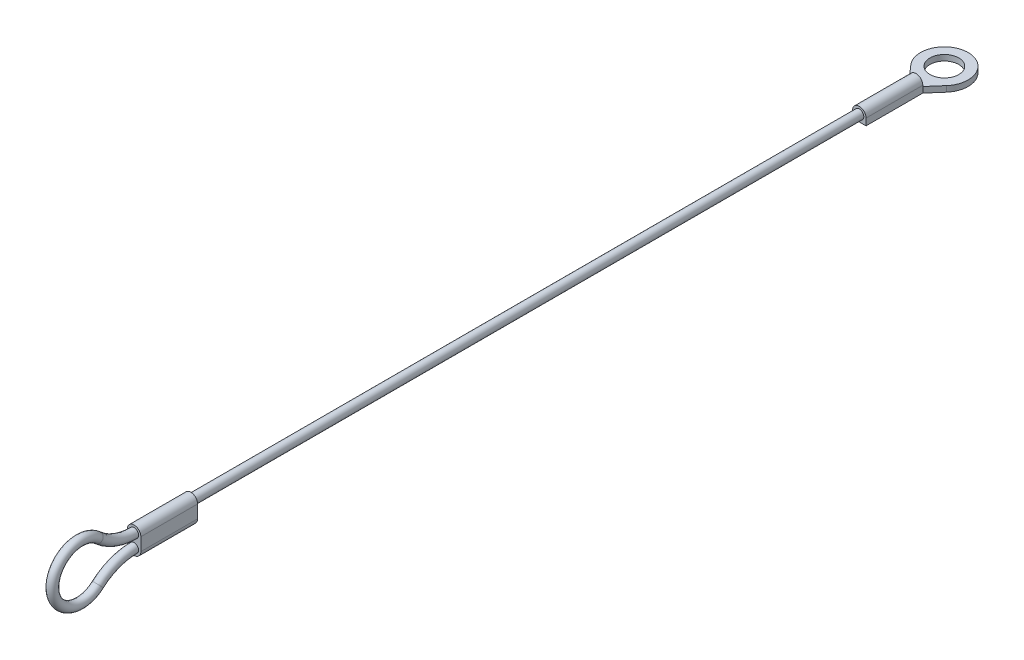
ISO-10303-21;
HEADER;
FILE_DESCRIPTION(('STEP AP214'),'2;1');
FILE_NAME('part.step','',(''),(''),'','','');
FILE_SCHEMA(('AUTOMOTIVE_DESIGN { 1 0 10303 214 1 1 1 1 }'));
ENDSEC;
DATA;
#1=APPLICATION_CONTEXT('core data for automotive mechanical design processes');
#2=APPLICATION_PROTOCOL_DEFINITION('international standard','automotive_design',2000,#1);
#3=PRODUCT_CONTEXT('',#1,'mechanical');
#4=PRODUCT('Part','Part','',(#3));
#5=PRODUCT_RELATED_PRODUCT_CATEGORY('part','',(#4));
#6=PRODUCT_DEFINITION_FORMATION('','',#4);
#7=PRODUCT_DEFINITION_CONTEXT('part definition',#1,'design');
#8=PRODUCT_DEFINITION('design','',#6,#7);
#9=PRODUCT_DEFINITION_SHAPE('','',#8);
#10=(LENGTH_UNIT() NAMED_UNIT(*) SI_UNIT(.MILLI.,.METRE.));
#11=(NAMED_UNIT(*) PLANE_ANGLE_UNIT() SI_UNIT($,.RADIAN.));
#12=(NAMED_UNIT(*) SI_UNIT($,.STERADIAN.) SOLID_ANGLE_UNIT());
#13=UNCERTAINTY_MEASURE_WITH_UNIT(LENGTH_MEASURE(1.E-05),#10,'distance_accuracy_value','');
#14=(GEOMETRIC_REPRESENTATION_CONTEXT(3) GLOBAL_UNCERTAINTY_ASSIGNED_CONTEXT((#13)) GLOBAL_UNIT_ASSIGNED_CONTEXT((#10,
#11,#12)) REPRESENTATION_CONTEXT('',''));
#15=CARTESIAN_POINT('',(0.,0.,0.));
#16=DIRECTION('',(0.,0.,1.));
#17=DIRECTION('',(1.,0.,0.));
#18=AXIS2_PLACEMENT_3D('',#15,#16,#17);
#19=CARTESIAN_POINT('',(0.,0.,-10.));
#20=DIRECTION('',(0.,0.,-1.));
#21=DIRECTION('',(-1.,0.,0.));
#22=AXIS2_PLACEMENT_3D('',#19,#20,#21);
#23=PLANE('',#22);
#24=DIRECTION('',(0.,-1.,0.));
#25=VECTOR('',#24,1.);
#26=CARTESIAN_POINT('',(1.195,0.,-10.));
#27=LINE('',#26,#25);
#28=CARTESIAN_POINT('',(1.195,0.,-10.));
#29=VERTEX_POINT('',#28);
#30=CARTESIAN_POINT('',(1.195,-0.185,-10.));
#31=VERTEX_POINT('',#30);
#32=EDGE_CURVE('E188',#29,#31,#27,.T.);
#33=ORIENTED_EDGE('',*,*,#32,.T.);
#34=DIRECTION('',(-1.,0.,0.));
#35=VECTOR('',#34,1.);
#36=CARTESIAN_POINT('',(-1.195,-0.185,-10.));
#37=LINE('',#36,#35);
#38=CARTESIAN_POINT('',(-1.195,-0.185,-10.));
#39=VERTEX_POINT('',#38);
#40=EDGE_CURVE('E146',#31,#39,#37,.T.);
#41=ORIENTED_EDGE('',*,*,#40,.T.);
#42=DIRECTION('',(0.,1.,0.));
#43=VECTOR('',#42,1.);
#44=CARTESIAN_POINT('',(-1.195,-1.195,-10.));
#45=LINE('',#44,#43);
#46=CARTESIAN_POINT('',(-1.195,0.,-10.));
#47=VERTEX_POINT('',#46);
#48=EDGE_CURVE('E193',#39,#47,#45,.T.);
#49=ORIENTED_EDGE('',*,*,#48,.T.);
#50=CARTESIAN_POINT('',(0.,0.,-10.));
#51=DIRECTION('',(0.,0.,-1.));
#52=DIRECTION('',(-1.,0.,0.));
#53=AXIS2_PLACEMENT_3D('',#50,#51,#52);
#54=CIRCLE('',#53,1.195);
#55=EDGE_CURVE('E184',#47,#29,#54,.T.);
#56=ORIENTED_EDGE('',*,*,#55,.T.);
#57=EDGE_LOOP('',(#33,#41,#49,#56));
#58=FACE_BOUND('',#57,.T.);
#59=ADVANCED_FACE('F39',(#58),#23,.T.);
#60=CARTESIAN_POINT('',(0.,0.,127.8));
#61=DIRECTION('',(0.,0.,-1.));
#62=DIRECTION('',(-1.,0.,0.));
#63=AXIS2_PLACEMENT_3D('',#60,#61,#62);
#64=CYLINDRICAL_SURFACE('',#63,0.795);
#65=CARTESIAN_POINT('',(0.,0.,117.8));
#66=DIRECTION('',(0.,0.,-1.));
#67=DIRECTION('',(0.,1.,0.));
#68=AXIS2_PLACEMENT_3D('',#65,#66,#67);
#69=CIRCLE('',#68,0.795);
#70=CARTESIAN_POINT('',(0.,0.795,117.8));
#71=VERTEX_POINT('',#70);
#72=EDGE_CURVE('E43',#71,#71,#69,.T.);
#73=ORIENTED_EDGE('',*,*,#72,.T.);
#74=EDGE_LOOP('',(#73));
#75=FACE_BOUND('',#74,.T.);
#76=CARTESIAN_POINT('',(0.,0.,0.));
#77=DIRECTION('',(0.,0.,1.));
#78=DIRECTION('',(1.,0.,0.));
#79=AXIS2_PLACEMENT_3D('',#76,#77,#78);
#80=CIRCLE('',#79,0.795);
#81=CARTESIAN_POINT('',(0.795,0.,0.));
#82=VERTEX_POINT('',#81);
#83=EDGE_CURVE('E223',#82,#82,#80,.T.);
#84=ORIENTED_EDGE('',*,*,#83,.T.);
#85=EDGE_LOOP('',(#84));
#86=FACE_BOUND('',#85,.T.);
#87=ADVANCED_FACE('F41',(#75,#86),#64,.T.);
#88=CARTESIAN_POINT('',(0.,1.70292021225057E-13,117.8));
#89=DIRECTION('',(0.,0.,1.));
#90=DIRECTION('',(0.,-1.,0.));
#91=AXIS2_PLACEMENT_3D('',#88,#89,#90);
#92=CYLINDRICAL_SURFACE('',#91,1.195);
#93=CARTESIAN_POINT('',(0.,1.8474805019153E-13,127.8));
#94=DIRECTION('',(0.,0.,-1.));
#95=DIRECTION('',(0.,1.,0.));
#96=AXIS2_PLACEMENT_3D('',#93,#94,#95);
#97=CIRCLE('',#96,1.195);
#98=CARTESIAN_POINT('',(-1.195,1.84894395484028E-13,127.8));
#99=VERTEX_POINT('',#98);
#100=CARTESIAN_POINT('',(1.195,1.84601704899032E-13,127.8));
#101=VERTEX_POINT('',#100);
#102=EDGE_CURVE('E235',#99,#101,#97,.T.);
#103=ORIENTED_EDGE('',*,*,#102,.T.);
#104=DIRECTION('',(0.,0.,1.));
#105=VECTOR('',#104,1.);
#106=CARTESIAN_POINT('',(1.195,1.70145675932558E-13,117.8));
#107=LINE('',#106,#105);
#108=CARTESIAN_POINT('',(1.195,1.70145675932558E-13,117.8));
#109=VERTEX_POINT('',#108);
#110=EDGE_CURVE('E256',#109,#101,#107,.T.);
#111=ORIENTED_EDGE('',*,*,#110,.F.);
#112=CARTESIAN_POINT('',(0.,1.70292021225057E-13,117.8));
#113=DIRECTION('',(0.,0.,-1.));
#114=DIRECTION('',(0.,1.,0.));
#115=AXIS2_PLACEMENT_3D('',#112,#113,#114);
#116=CIRCLE('',#115,1.195);
#117=CARTESIAN_POINT('',(-1.195,1.70438366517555E-13,117.8));
#118=VERTEX_POINT('',#117);
#119=EDGE_CURVE('E224',#118,#109,#116,.T.);
#120=ORIENTED_EDGE('',*,*,#119,.F.);
#121=DIRECTION('',(0.,0.,1.));
#122=VECTOR('',#121,1.);
#123=CARTESIAN_POINT('',(-1.195,1.70438366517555E-13,117.8));
#124=LINE('',#123,#122);
#125=EDGE_CURVE('E234',#118,#99,#124,.T.);
#126=ORIENTED_EDGE('',*,*,#125,.T.);
#127=EDGE_LOOP('',(#103,#111,#120,#126));
#128=FACE_BOUND('',#127,.T.);
#129=ADVANCED_FACE('F324',(#128),#92,.T.);
#130=CARTESIAN_POINT('',(1.195,1.70145675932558E-13,117.8));
#131=DIRECTION('',(-1.,0.,0.));
#132=DIRECTION('',(0.,-1.,0.));
#133=AXIS2_PLACEMENT_3D('',#130,#131,#132);
#134=PLANE('',#133);
#135=DIRECTION('',(0.,-1.,0.));
#136=VECTOR('',#135,1.);
#137=CARTESIAN_POINT('',(1.195,1.84601704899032E-13,127.8));
#138=LINE('',#137,#136);
#139=CARTESIAN_POINT('',(1.195,-2.26625258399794,127.8));
#140=VERTEX_POINT('',#139);
#141=EDGE_CURVE('E239',#101,#140,#138,.T.);
#142=ORIENTED_EDGE('',*,*,#141,.T.);
#143=DIRECTION('',(0.,0.,1.));
#144=VECTOR('',#143,1.);
#145=CARTESIAN_POINT('',(1.195,-2.26625258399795,117.8));
#146=LINE('',#145,#144);
#147=CARTESIAN_POINT('',(1.195,-2.26625258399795,117.8));
#148=VERTEX_POINT('',#147);
#149=EDGE_CURVE('E252',#148,#140,#146,.T.);
#150=ORIENTED_EDGE('',*,*,#149,.F.);
#151=DIRECTION('',(0.,-1.,0.));
#152=VECTOR('',#151,1.);
#153=CARTESIAN_POINT('',(1.195,1.70145675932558E-13,117.8));
#154=LINE('',#153,#152);
#155=EDGE_CURVE('E95',#109,#148,#154,.T.);
#156=ORIENTED_EDGE('',*,*,#155,.F.);
#157=ORIENTED_EDGE('',*,*,#110,.T.);
#158=EDGE_LOOP('',(#142,#150,#156,#157));
#159=FACE_BOUND('',#158,.T.);
#160=ADVANCED_FACE('F448',(#159),#134,.F.);
#161=CARTESIAN_POINT('',(0.,-2.26625258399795,117.8));
#162=DIRECTION('',(0.,0.,1.));
#163=DIRECTION('',(0.,-1.,0.));
#164=AXIS2_PLACEMENT_3D('',#161,#162,#163);
#165=CYLINDRICAL_SURFACE('',#164,1.195);
#166=CARTESIAN_POINT('',(0.,-2.26625258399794,127.8));
#167=DIRECTION('',(0.,0.,-1.));
#168=DIRECTION('',(0.,1.,0.));
#169=AXIS2_PLACEMENT_3D('',#166,#167,#168);
#170=CIRCLE('',#169,1.195);
#171=CARTESIAN_POINT('',(-1.195,-2.26625258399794,127.8));
#172=VERTEX_POINT('',#171);
#173=EDGE_CURVE('E242',#140,#172,#170,.T.);
#174=ORIENTED_EDGE('',*,*,#173,.T.);
#175=DIRECTION('',(0.,0.,1.));
#176=VECTOR('',#175,1.);
#177=CARTESIAN_POINT('',(-1.195,-2.26625258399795,117.8));
#178=LINE('',#177,#176);
#179=CARTESIAN_POINT('',(-1.195,-2.26625258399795,117.8));
#180=VERTEX_POINT('',#179);
#181=EDGE_CURVE('E249',#180,#172,#178,.T.);
#182=ORIENTED_EDGE('',*,*,#181,.F.);
#183=CARTESIAN_POINT('',(0.,-2.26625258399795,117.8));
#184=DIRECTION('',(0.,0.,-1.));
#185=DIRECTION('',(0.,1.,0.));
#186=AXIS2_PLACEMENT_3D('',#183,#184,#185);
#187=CIRCLE('',#186,1.195);
#188=EDGE_CURVE('E229',#148,#180,#187,.T.);
#189=ORIENTED_EDGE('',*,*,#188,.F.);
#190=ORIENTED_EDGE('',*,*,#149,.T.);
#191=EDGE_LOOP('',(#174,#182,#189,#190));
#192=FACE_BOUND('',#191,.T.);
#193=ADVANCED_FACE('F439',(#192),#165,.T.);
#194=CARTESIAN_POINT('',(-1.195,1.70438366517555E-13,117.8));
#195=DIRECTION('',(1.,0.,0.));
#196=DIRECTION('',(0.,1.,0.));
#197=AXIS2_PLACEMENT_3D('',#194,#195,#196);
#198=PLANE('',#197);
#199=DIRECTION('',(0.,1.,0.));
#200=VECTOR('',#199,1.);
#201=CARTESIAN_POINT('',(-1.195,1.84894395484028E-13,127.8));
#202=LINE('',#201,#200);
#203=EDGE_CURVE('E87',#172,#99,#202,.T.);
#204=ORIENTED_EDGE('',*,*,#203,.T.);
#205=ORIENTED_EDGE('',*,*,#125,.F.);
#206=DIRECTION('',(0.,1.,0.));
#207=VECTOR('',#206,1.);
#208=CARTESIAN_POINT('',(-1.195,1.70438366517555E-13,117.8));
#209=LINE('',#208,#207);
#210=EDGE_CURVE('E66',#180,#118,#209,.T.);
#211=ORIENTED_EDGE('',*,*,#210,.F.);
#212=ORIENTED_EDGE('',*,*,#181,.T.);
#213=EDGE_LOOP('',(#204,#205,#211,#212));
#214=FACE_BOUND('',#213,.T.);
#215=ADVANCED_FACE('F429',(#214),#198,.F.);
#216=CARTESIAN_POINT('',(0.,1.70292021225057E-13,117.8));
#217=DIRECTION('',(0.,0.,-1.));
#218=DIRECTION('',(0.,1.,0.));
#219=AXIS2_PLACEMENT_3D('',#216,#217,#218);
#220=PLANE('',#219);
#221=ORIENTED_EDGE('',*,*,#72,.F.);
#222=EDGE_LOOP('',(#221));
#223=FACE_BOUND('',#222,.T.);
#224=ORIENTED_EDGE('',*,*,#119,.T.);
#225=ORIENTED_EDGE('',*,*,#155,.T.);
#226=ORIENTED_EDGE('',*,*,#188,.T.);
#227=ORIENTED_EDGE('',*,*,#210,.T.);
#228=EDGE_LOOP('',(#224,#225,#226,#227));
#229=FACE_BOUND('',#228,.T.);
#230=ADVANCED_FACE('F418',(#223,#229),#220,.T.);
#231=CARTESIAN_POINT('',(0.,1.8474805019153E-13,127.8));
#232=DIRECTION('',(0.,0.,-1.));
#233=DIRECTION('',(0.,1.,0.));
#234=AXIS2_PLACEMENT_3D('',#231,#232,#233);
#235=PLANE('',#234);
#236=CARTESIAN_POINT('',(0.,-2.26625258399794,127.8));
#237=DIRECTION('',(0.,0.,-1.));
#238=DIRECTION('',(1.,0.,0.));
#239=AXIS2_PLACEMENT_3D('',#236,#237,#238);
#240=CIRCLE('',#239,0.795);
#241=CARTESIAN_POINT('',(0.,-1.47125258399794,127.8));
#242=VERTEX_POINT('',#241);
#243=EDGE_CURVE('E263',#242,#242,#240,.T.);
#244=ORIENTED_EDGE('',*,*,#243,.T.);
#245=EDGE_LOOP('',(#244));
#246=FACE_BOUND('',#245,.T.);
#247=CARTESIAN_POINT('',(0.,0.,127.8));
#248=DIRECTION('',(0.,0.,-1.));
#249=DIRECTION('',(0.,1.,0.));
#250=AXIS2_PLACEMENT_3D('',#247,#248,#249);
#251=CIRCLE('',#250,0.795);
#252=CARTESIAN_POINT('',(0.,-0.795000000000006,127.8));
#253=VERTEX_POINT('',#252);
#254=EDGE_CURVE('E259',#253,#253,#251,.T.);
#255=ORIENTED_EDGE('',*,*,#254,.T.);
#256=EDGE_LOOP('',(#255));
#257=FACE_BOUND('',#256,.T.);
#258=ORIENTED_EDGE('',*,*,#102,.F.);
#259=ORIENTED_EDGE('',*,*,#203,.F.);
#260=ORIENTED_EDGE('',*,*,#173,.F.);
#261=ORIENTED_EDGE('',*,*,#141,.F.);
#262=EDGE_LOOP('',(#258,#259,#260,#261));
#263=FACE_BOUND('',#262,.T.);
#264=ADVANCED_FACE('F412',(#246,#257,#263),#235,.F.);
#265=CARTESIAN_POINT('',(0.,-11.8662525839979,127.8));
#266=DIRECTION('',(1.,0.,0.));
#267=DIRECTION('',(0.,0.,-1.));
#268=AXIS2_PLACEMENT_3D('',#265,#266,#267);
#269=TOROIDAL_SURFACE('',#268,9.6,0.795);
#270=CARTESIAN_POINT('',(0.,-4.71083505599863,134.2));
#271=DIRECTION('',(0.,0.666666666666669,-0.745355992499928));
#272=DIRECTION('',(1.,0.,0.));
#273=AXIS2_PLACEMENT_3D('',#270,#271,#272);
#274=CIRCLE('',#273,0.795);
#275=CARTESIAN_POINT('',(0.,-4.11827704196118,134.73));
#276=VERTEX_POINT('',#275);
#277=EDGE_CURVE('E49',#276,#276,#274,.T.);
#278=CARTESIAN_POINT('',(0.,-11.8662525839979,127.8));
#279=DIRECTION('',(1.,0.,0.));
#280=DIRECTION('',(0.,0.,-1.));
#281=AXIS2_PLACEMENT_3D('',#278,#279,#280);
#282=CIRCLE('',#281,10.395);
#283=EDGE_CURVE('',#242,#276,#282,.T.);
#284=ORIENTED_EDGE('',*,*,#243,.F.);
#285=ORIENTED_EDGE('',*,*,#277,.T.);
#286=ORIENTED_EDGE('',*,*,#283,.T.);
#287=ORIENTED_EDGE('',*,*,#283,.F.);
#288=EDGE_LOOP('',(#284,#286,#285,#287));
#289=FACE_BOUND('',#288,.T.);
#290=ADVANCED_FACE('F417',(#289),#269,.T.);
#291=CARTESIAN_POINT('',(0.,-1.13312629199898,137.4));
#292=DIRECTION('',(-1.,0.,0.));
#293=DIRECTION('',(0.,0.,1.));
#294=AXIS2_PLACEMENT_3D('',#291,#292,#293);
#295=TOROIDAL_SURFACE('',#294,4.79999999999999,0.795);
#296=CARTESIAN_POINT('',(0.,2.44458247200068,134.2));
#297=DIRECTION('',(0.,0.666666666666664,0.745355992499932));
#298=DIRECTION('',(1.,0.,0.));
#299=AXIS2_PLACEMENT_3D('',#296,#297,#298);
#300=CIRCLE('',#299,0.795);
#301=CARTESIAN_POINT('',(0.,1.85202445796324,134.73));
#302=VERTEX_POINT('',#301);
#303=EDGE_CURVE('E11',#302,#302,#300,.T.);
#304=ORIENTED_EDGE('',*,*,#303,.T.);
#305=EDGE_LOOP('',(#304));
#306=FACE_BOUND('',#305,.T.);
#307=ORIENTED_EDGE('',*,*,#277,.F.);
#308=EDGE_LOOP('',(#307));
#309=FACE_BOUND('',#308,.T.);
#310=ADVANCED_FACE('F479',(#306,#309),#295,.T.);
#311=CARTESIAN_POINT('',(0.,9.6,127.8));
#312=DIRECTION('',(1.,0.,0.));
#313=DIRECTION('',(0.,0.,-1.));
#314=AXIS2_PLACEMENT_3D('',#311,#312,#313);
#315=TOROIDAL_SURFACE('',#314,9.6,0.795);
#316=CARTESIAN_POINT('',(0.,9.6,127.8));
#317=DIRECTION('',(1.,0.,0.));
#318=DIRECTION('',(0.,0.,-1.));
#319=AXIS2_PLACEMENT_3D('',#316,#317,#318);
#320=CIRCLE('',#319,10.395);
#321=EDGE_CURVE('',#302,#253,#320,.T.);
#322=ORIENTED_EDGE('',*,*,#303,.F.);
#323=ORIENTED_EDGE('',*,*,#254,.F.);
#324=ORIENTED_EDGE('',*,*,#321,.T.);
#325=ORIENTED_EDGE('',*,*,#321,.F.);
#326=EDGE_LOOP('',(#322,#324,#323,#325));
#327=FACE_BOUND('',#326,.T.);
#328=ADVANCED_FACE('F406',(#327),#315,.T.);
#329=CARTESIAN_POINT('',(0.,0.,-10.));
#330=DIRECTION('',(0.,0.,1.));
#331=DIRECTION('',(1.,0.,0.));
#332=AXIS2_PLACEMENT_3D('',#329,#330,#331);
#333=CYLINDRICAL_SURFACE('',#332,1.195);
#334=CARTESIAN_POINT('',(0.,0.,0.));
#335=DIRECTION('',(0.,0.,-1.));
#336=DIRECTION('',(-1.,0.,0.));
#337=AXIS2_PLACEMENT_3D('',#334,#335,#336);
#338=CIRCLE('',#337,1.195);
#339=CARTESIAN_POINT('',(-1.195,0.,0.));
#340=VERTEX_POINT('',#339);
#341=CARTESIAN_POINT('',(1.195,0.,0.));
#342=VERTEX_POINT('',#341);
#343=EDGE_CURVE('E182',#340,#342,#338,.T.);
#344=ORIENTED_EDGE('',*,*,#343,.T.);
#345=DIRECTION('',(0.,0.,1.));
#346=VECTOR('',#345,1.);
#347=CARTESIAN_POINT('',(1.195,0.,-10.));
#348=LINE('',#347,#346);
#349=EDGE_CURVE('E219',#29,#342,#348,.T.);
#350=ORIENTED_EDGE('',*,*,#349,.F.);
#351=ORIENTED_EDGE('',*,*,#55,.F.);
#352=DIRECTION('',(0.,0.,1.));
#353=VECTOR('',#352,1.);
#354=CARTESIAN_POINT('',(-1.195,0.,-10.));
#355=LINE('',#354,#353);
#356=EDGE_CURVE('E196',#47,#340,#355,.T.);
#357=ORIENTED_EDGE('',*,*,#356,.T.);
#358=EDGE_LOOP('',(#344,#350,#351,#357));
#359=FACE_BOUND('',#358,.T.);
#360=ADVANCED_FACE('F283',(#359),#333,.T.);
#361=CARTESIAN_POINT('',(1.195,0.,-10.));
#362=DIRECTION('',(-1.,0.,0.));
#363=DIRECTION('',(0.,-1.,0.));
#364=AXIS2_PLACEMENT_3D('',#361,#362,#363);
#365=PLANE('',#364);
#366=DIRECTION('',(0.,-1.,0.));
#367=VECTOR('',#366,1.);
#368=CARTESIAN_POINT('',(1.195,0.,0.));
#369=LINE('',#368,#367);
#370=CARTESIAN_POINT('',(1.195,-1.195,0.));
#371=VERTEX_POINT('',#370);
#372=EDGE_CURVE('E200',#342,#371,#369,.T.);
#373=ORIENTED_EDGE('',*,*,#372,.T.);
#374=DIRECTION('',(0.,0.,1.));
#375=VECTOR('',#374,1.);
#376=CARTESIAN_POINT('',(1.195,-1.195,-10.));
#377=LINE('',#376,#375);
#378=CARTESIAN_POINT('',(1.195,-1.195,-10.));
#379=VERTEX_POINT('',#378);
#380=EDGE_CURVE('E215',#379,#371,#377,.T.);
#381=ORIENTED_EDGE('',*,*,#380,.F.);
#382=DIRECTION('',(0.,-1.,0.));
#383=VECTOR('',#382,1.);
#384=CARTESIAN_POINT('',(1.195,-0.185,-10.));
#385=LINE('',#384,#383);
#386=EDGE_CURVE('E179',#31,#379,#385,.T.);
#387=ORIENTED_EDGE('',*,*,#386,.F.);
#388=ORIENTED_EDGE('',*,*,#32,.F.);
#389=ORIENTED_EDGE('',*,*,#349,.T.);
#390=EDGE_LOOP('',(#373,#381,#387,#388,#389));
#391=FACE_BOUND('',#390,.T.);
#392=ADVANCED_FACE('F294',(#391),#365,.F.);
#393=CARTESIAN_POINT('',(0.,-1.195,-10.));
#394=DIRECTION('',(0.,1.,0.));
#395=DIRECTION('',(0.,0.,1.));
#396=AXIS2_PLACEMENT_3D('',#393,#394,#395);
#397=PLANE('',#396);
#398=DIRECTION('',(-1.,0.,0.));
#399=VECTOR('',#398,1.);
#400=CARTESIAN_POINT('',(0.,-1.195,0.));
#401=LINE('',#400,#399);
#402=CARTESIAN_POINT('',(-1.195,-1.195,0.));
#403=VERTEX_POINT('',#402);
#404=EDGE_CURVE('E204',#371,#403,#401,.T.);
#405=ORIENTED_EDGE('',*,*,#404,.T.);
#406=DIRECTION('',(0.,0.,1.));
#407=VECTOR('',#406,1.);
#408=CARTESIAN_POINT('',(-1.195,-1.195,-10.));
#409=LINE('',#408,#407);
#410=CARTESIAN_POINT('',(-1.195,-1.195,-10.));
#411=VERTEX_POINT('',#410);
#412=EDGE_CURVE('E211',#411,#403,#409,.T.);
#413=ORIENTED_EDGE('',*,*,#412,.F.);
#414=DIRECTION('',(-0.658036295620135,0.,-0.752986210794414));
#415=VECTOR('',#414,1.);
#416=CARTESIAN_POINT('',(-3.1550122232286,-1.195,-12.2428279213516));
#417=LINE('',#416,#415);
#418=CARTESIAN_POINT('',(-3.1550122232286,-1.195,-12.2428279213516));
#419=VERTEX_POINT('',#418);
#420=EDGE_CURVE('E173',#411,#419,#417,.T.);
#421=ORIENTED_EDGE('',*,*,#420,.T.);
#422=CARTESIAN_POINT('',(0.,-1.195,-15.));
#423=DIRECTION('',(0.,-1.,0.));
#424=DIRECTION('',(0.,0.,1.));
#425=AXIS2_PLACEMENT_3D('',#422,#423,#424);
#426=CIRCLE('',#425,4.19);
#427=CARTESIAN_POINT('',(3.1550122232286,-1.195,-12.2428279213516));
#428=VERTEX_POINT('',#427);
#429=EDGE_CURVE('E141',#419,#428,#426,.T.);
#430=ORIENTED_EDGE('',*,*,#429,.T.);
#431=DIRECTION('',(-0.658036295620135,0.,0.752986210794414));
#432=VECTOR('',#431,1.);
#433=CARTESIAN_POINT('',(1.195,-1.195,-10.));
#434=LINE('',#433,#432);
#435=EDGE_CURVE('E158',#428,#379,#434,.T.);
#436=ORIENTED_EDGE('',*,*,#435,.T.);
#437=ORIENTED_EDGE('',*,*,#380,.T.);
#438=EDGE_LOOP('',(#405,#413,#421,#430,#436,#437));
#439=FACE_BOUND('',#438,.T.);
#440=CARTESIAN_POINT('',(0.,-1.195,-15.));
#441=DIRECTION('',(0.,-1.,0.));
#442=DIRECTION('',(0.,0.,-1.));
#443=AXIS2_PLACEMENT_3D('',#440,#441,#442);
#444=CIRCLE('',#443,2.54);
#445=CARTESIAN_POINT('',(0.,-1.195,-17.54));
#446=VERTEX_POINT('',#445);
#447=EDGE_CURVE('E166',#446,#446,#444,.T.);
#448=ORIENTED_EDGE('',*,*,#447,.F.);
#449=EDGE_LOOP('',(#448));
#450=FACE_BOUND('',#449,.T.);
#451=ADVANCED_FACE('F290',(#439,#450),#397,.F.);
#452=CARTESIAN_POINT('',(-1.195,-1.195,-10.));
#453=DIRECTION('',(1.,0.,0.));
#454=DIRECTION('',(0.,1.,0.));
#455=AXIS2_PLACEMENT_3D('',#452,#453,#454);
#456=PLANE('',#455);
#457=DIRECTION('',(0.,1.,0.));
#458=VECTOR('',#457,1.);
#459=CARTESIAN_POINT('',(-1.195,-1.195,0.));
#460=LINE('',#459,#458);
#461=EDGE_CURVE('E189',#403,#340,#460,.T.);
#462=ORIENTED_EDGE('',*,*,#461,.T.);
#463=ORIENTED_EDGE('',*,*,#356,.F.);
#464=ORIENTED_EDGE('',*,*,#48,.F.);
#465=EDGE_CURVE('E155',#411,#39,#45,.T.);
#466=ORIENTED_EDGE('',*,*,#465,.F.);
#467=ORIENTED_EDGE('',*,*,#412,.T.);
#468=EDGE_LOOP('',(#462,#463,#464,#466,#467));
#469=FACE_BOUND('',#468,.T.);
#470=ADVANCED_FACE('F277',(#469),#456,.F.);
#471=CARTESIAN_POINT('',(0.,0.,0.));
#472=DIRECTION('',(0.,0.,-1.));
#473=DIRECTION('',(-1.,0.,0.));
#474=AXIS2_PLACEMENT_3D('',#471,#472,#473);
#475=PLANE('',#474);
#476=ORIENTED_EDGE('',*,*,#83,.F.);
#477=EDGE_LOOP('',(#476));
#478=FACE_BOUND('',#477,.T.);
#479=ORIENTED_EDGE('',*,*,#343,.F.);
#480=ORIENTED_EDGE('',*,*,#461,.F.);
#481=ORIENTED_EDGE('',*,*,#404,.F.);
#482=ORIENTED_EDGE('',*,*,#372,.F.);
#483=EDGE_LOOP('',(#479,#480,#481,#482));
#484=FACE_BOUND('',#483,.T.);
#485=ADVANCED_FACE('F274',(#478,#484),#475,.F.);
#486=CARTESIAN_POINT('',(-3.1550122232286,-0.185,-12.2428279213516));
#487=DIRECTION('',(-0.752986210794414,0.,0.658036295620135));
#488=DIRECTION('',(0.658036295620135,0.,0.752986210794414));
#489=AXIS2_PLACEMENT_3D('',#486,#487,#488);
#490=PLANE('',#489);
#491=ORIENTED_EDGE('',*,*,#420,.F.);
#492=ORIENTED_EDGE('',*,*,#465,.T.);
#493=DIRECTION('',(-0.658036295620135,0.,-0.752986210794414));
#494=VECTOR('',#493,1.);
#495=CARTESIAN_POINT('',(-3.1550122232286,-0.185,-12.2428279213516));
#496=LINE('',#495,#494);
#497=CARTESIAN_POINT('',(-3.1550122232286,-0.185,-12.2428279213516));
#498=VERTEX_POINT('',#497);
#499=EDGE_CURVE('E57',#39,#498,#496,.T.);
#500=ORIENTED_EDGE('',*,*,#499,.T.);
#501=DIRECTION('',(0.,-1.,0.));
#502=VECTOR('',#501,1.);
#503=CARTESIAN_POINT('',(-3.1550122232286,-0.185,-12.2428279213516));
#504=LINE('',#503,#502);
#505=EDGE_CURVE('E137',#498,#419,#504,.T.);
#506=ORIENTED_EDGE('',*,*,#505,.T.);
#507=EDGE_LOOP('',(#491,#492,#500,#506));
#508=FACE_BOUND('',#507,.T.);
#509=ADVANCED_FACE('F153',(#508),#490,.T.);
#510=CARTESIAN_POINT('',(1.195,-0.185,-10.));
#511=DIRECTION('',(0.752986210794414,0.,0.658036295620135));
#512=DIRECTION('',(0.658036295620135,0.,-0.752986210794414));
#513=AXIS2_PLACEMENT_3D('',#510,#511,#512);
#514=PLANE('',#513);
#515=ORIENTED_EDGE('',*,*,#435,.F.);
#516=DIRECTION('',(0.,-1.,0.));
#517=VECTOR('',#516,1.);
#518=CARTESIAN_POINT('',(3.1550122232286,-0.185,-12.2428279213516));
#519=LINE('',#518,#517);
#520=CARTESIAN_POINT('',(3.1550122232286,-0.185,-12.2428279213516));
#521=VERTEX_POINT('',#520);
#522=EDGE_CURVE('E145',#521,#428,#519,.T.);
#523=ORIENTED_EDGE('',*,*,#522,.F.);
#524=DIRECTION('',(-0.658036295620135,0.,0.752986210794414));
#525=VECTOR('',#524,1.);
#526=CARTESIAN_POINT('',(1.195,-0.185,-10.));
#527=LINE('',#526,#525);
#528=EDGE_CURVE('E150',#521,#31,#527,.T.);
#529=ORIENTED_EDGE('',*,*,#528,.T.);
#530=ORIENTED_EDGE('',*,*,#386,.T.);
#531=EDGE_LOOP('',(#515,#523,#529,#530));
#532=FACE_BOUND('',#531,.T.);
#533=ADVANCED_FACE('F329',(#532),#514,.T.);
#534=CARTESIAN_POINT('',(0.,-0.185,-15.));
#535=DIRECTION('',(0.,-1.,0.));
#536=DIRECTION('',(0.,0.,-1.));
#537=AXIS2_PLACEMENT_3D('',#534,#535,#536);
#538=CYLINDRICAL_SURFACE('',#537,4.19);
#539=ORIENTED_EDGE('',*,*,#429,.F.);
#540=ORIENTED_EDGE('',*,*,#505,.F.);
#541=CARTESIAN_POINT('',(0.,-0.185,-15.));
#542=DIRECTION('',(0.,-1.,0.));
#543=DIRECTION('',(0.,0.,1.));
#544=AXIS2_PLACEMENT_3D('',#541,#542,#543);
#545=CIRCLE('',#544,4.19);
#546=EDGE_CURVE('E139',#498,#521,#545,.T.);
#547=ORIENTED_EDGE('',*,*,#546,.T.);
#548=ORIENTED_EDGE('',*,*,#522,.T.);
#549=EDGE_LOOP('',(#539,#540,#547,#548));
#550=FACE_BOUND('',#549,.T.);
#551=ADVANCED_FACE('F138',(#550),#538,.T.);
#552=CARTESIAN_POINT('',(0.,-0.185,-15.));
#553=DIRECTION('',(0.,1.,0.));
#554=DIRECTION('',(0.,0.,1.));
#555=AXIS2_PLACEMENT_3D('',#552,#553,#554);
#556=PLANE('',#555);
#557=CARTESIAN_POINT('',(0.,-0.185,-15.));
#558=DIRECTION('',(0.,-1.,0.));
#559=DIRECTION('',(0.,0.,-1.));
#560=AXIS2_PLACEMENT_3D('',#557,#558,#559);
#561=CIRCLE('',#560,2.54);
#562=CARTESIAN_POINT('',(0.,-0.185,-17.54));
#563=VERTEX_POINT('',#562);
#564=EDGE_CURVE('E176',#563,#563,#561,.T.);
#565=ORIENTED_EDGE('',*,*,#564,.T.);
#566=EDGE_LOOP('',(#565));
#567=FACE_BOUND('',#566,.T.);
#568=ORIENTED_EDGE('',*,*,#499,.F.);
#569=ORIENTED_EDGE('',*,*,#40,.F.);
#570=ORIENTED_EDGE('',*,*,#528,.F.);
#571=ORIENTED_EDGE('',*,*,#546,.F.);
#572=EDGE_LOOP('',(#568,#569,#570,#571));
#573=FACE_BOUND('',#572,.T.);
#574=ADVANCED_FACE('F149',(#567,#573),#556,.T.);
#575=CARTESIAN_POINT('',(0.,-0.185,-15.));
#576=DIRECTION('',(0.,-1.,0.));
#577=DIRECTION('',(0.,0.,-1.));
#578=AXIS2_PLACEMENT_3D('',#575,#576,#577);
#579=CYLINDRICAL_SURFACE('',#578,2.54);
#580=ORIENTED_EDGE('',*,*,#564,.F.);
#581=EDGE_LOOP('',(#580));
#582=FACE_BOUND('',#581,.T.);
#583=ORIENTED_EDGE('',*,*,#447,.T.);
#584=EDGE_LOOP('',(#583));
#585=FACE_BOUND('',#584,.T.);
#586=ADVANCED_FACE('F306',(#582,#585),#579,.F.);
#587=CLOSED_SHELL('',(#59,#87,#129,#160,#193,#215,#230,#264,#290,#310,#328,#360,#392,#451,#470,
#485,#509,#533,#551,#574,#586));
#588=MANIFOLD_SOLID_BREP('B2',#587);
#589=ADVANCED_BREP_SHAPE_REPRESENTATION('',(#18,#588),#14);
#590=SHAPE_DEFINITION_REPRESENTATION(#9,#589);
ENDSEC;
END-ISO-10303-21;
